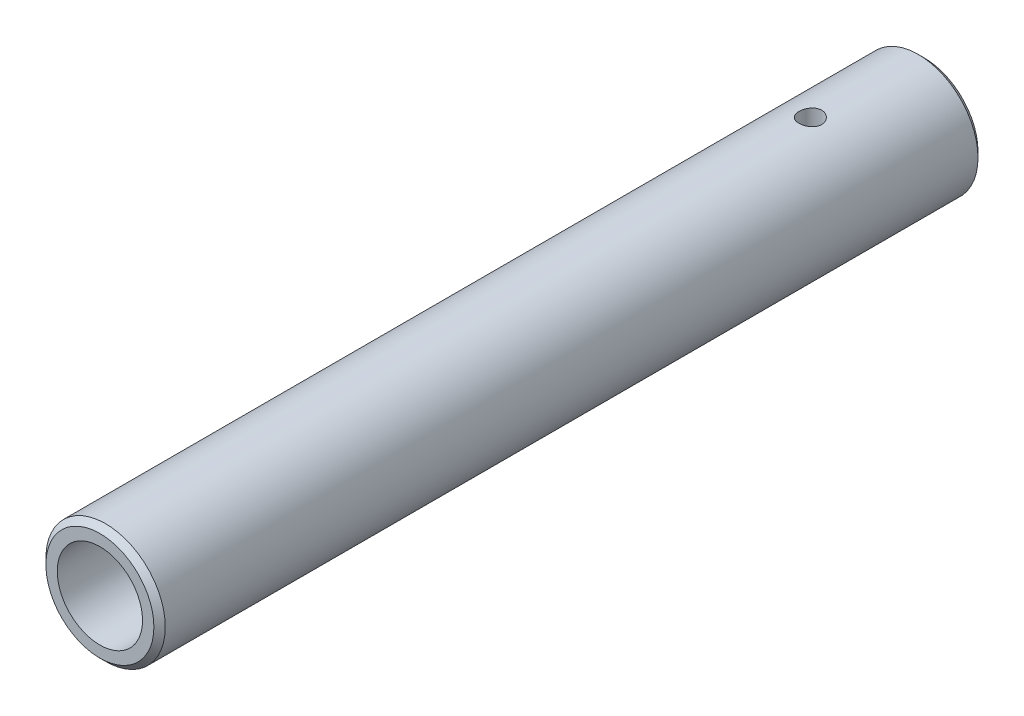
ISO-10303-21;
HEADER;
FILE_DESCRIPTION(('STEP AP214'),'2;1');
FILE_NAME('part.step','',(''),(''),'','','');
FILE_SCHEMA(('AUTOMOTIVE_DESIGN { 1 0 10303 214 1 1 1 1 }'));
ENDSEC;
DATA;
#1=APPLICATION_CONTEXT('core data for automotive mechanical design processes');
#2=APPLICATION_PROTOCOL_DEFINITION('international standard','automotive_design',2000,#1);
#3=PRODUCT_CONTEXT('',#1,'mechanical');
#4=PRODUCT('Part','Part','',(#3));
#5=PRODUCT_RELATED_PRODUCT_CATEGORY('part','',(#4));
#6=PRODUCT_DEFINITION_FORMATION('','',#4);
#7=PRODUCT_DEFINITION_CONTEXT('part definition',#1,'design');
#8=PRODUCT_DEFINITION('design','',#6,#7);
#9=PRODUCT_DEFINITION_SHAPE('','',#8);
#10=(LENGTH_UNIT() NAMED_UNIT(*) SI_UNIT(.MILLI.,.METRE.));
#11=(NAMED_UNIT(*) PLANE_ANGLE_UNIT() SI_UNIT($,.RADIAN.));
#12=(NAMED_UNIT(*) SI_UNIT($,.STERADIAN.) SOLID_ANGLE_UNIT());
#13=UNCERTAINTY_MEASURE_WITH_UNIT(LENGTH_MEASURE(1.E-05),#10,'distance_accuracy_value','');
#14=(GEOMETRIC_REPRESENTATION_CONTEXT(3) GLOBAL_UNCERTAINTY_ASSIGNED_CONTEXT((#13)) GLOBAL_UNIT_ASSIGNED_CONTEXT((#10,
#11,#12)) REPRESENTATION_CONTEXT('',''));
#15=CARTESIAN_POINT('',(0.,0.,0.));
#16=DIRECTION('',(0.,0.,1.));
#17=DIRECTION('',(1.,0.,0.));
#18=AXIS2_PLACEMENT_3D('',#15,#16,#17);
#19=CARTESIAN_POINT('',(0.,0.,145.));
#20=DIRECTION('',(0.,0.,1.));
#21=DIRECTION('',(1.,0.,0.));
#22=AXIS2_PLACEMENT_3D('',#19,#20,#21);
#23=PLANE('',#22);
#24=CARTESIAN_POINT('',(0.,0.,145.));
#25=DIRECTION('',(0.,0.,1.));
#26=DIRECTION('',(1.,0.,0.));
#27=AXIS2_PLACEMENT_3D('',#24,#25,#26);
#28=CIRCLE('',#27,9.5);
#29=CARTESIAN_POINT('',(9.5,0.,145.));
#30=VERTEX_POINT('',#29);
#31=EDGE_CURVE('E38',#30,#30,#28,.T.);
#32=ORIENTED_EDGE('',*,*,#31,.T.);
#33=EDGE_LOOP('',(#32));
#34=FACE_BOUND('',#33,.T.);
#35=CARTESIAN_POINT('',(0.,0.,145.));
#36=DIRECTION('',(0.,0.,1.));
#37=DIRECTION('',(1.,0.,0.));
#38=AXIS2_PLACEMENT_3D('',#35,#36,#37);
#39=CIRCLE('',#38,7.5);
#40=CARTESIAN_POINT('',(7.5,0.,145.));
#41=VERTEX_POINT('',#40);
#42=EDGE_CURVE('E43',#41,#41,#39,.T.);
#43=ORIENTED_EDGE('',*,*,#42,.F.);
#44=EDGE_LOOP('',(#43));
#45=FACE_BOUND('',#44,.T.);
#46=ADVANCED_FACE('F22',(#34,#45),#23,.T.);
#47=CARTESIAN_POINT('',(0.,0.,0.));
#48=DIRECTION('',(0.,0.,1.));
#49=DIRECTION('',(1.,0.,0.));
#50=AXIS2_PLACEMENT_3D('',#47,#48,#49);
#51=PLANE('',#50);
#52=CARTESIAN_POINT('',(0.,0.,0.));
#53=DIRECTION('',(0.,0.,1.));
#54=DIRECTION('',(1.,0.,0.));
#55=AXIS2_PLACEMENT_3D('',#52,#53,#54);
#56=CIRCLE('',#55,9.50000000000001);
#57=CARTESIAN_POINT('',(9.50000000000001,0.,0.));
#58=VERTEX_POINT('',#57);
#59=EDGE_CURVE('E10',#58,#58,#56,.F.);
#60=ORIENTED_EDGE('',*,*,#59,.T.);
#61=EDGE_LOOP('',(#60));
#62=FACE_BOUND('',#61,.T.);
#63=CARTESIAN_POINT('',(0.,0.,0.));
#64=DIRECTION('',(0.,0.,1.));
#65=DIRECTION('',(1.,0.,0.));
#66=AXIS2_PLACEMENT_3D('',#63,#64,#65);
#67=CIRCLE('',#66,7.5);
#68=CARTESIAN_POINT('',(7.5,0.,0.));
#69=VERTEX_POINT('',#68);
#70=EDGE_CURVE('E80',#69,#69,#67,.T.);
#71=ORIENTED_EDGE('',*,*,#70,.T.);
#72=EDGE_LOOP('',(#71));
#73=FACE_BOUND('',#72,.T.);
#74=ADVANCED_FACE('F88',(#62,#73),#51,.F.);
#75=CARTESIAN_POINT('',(0.,0.,145.));
#76=DIRECTION('',(0.,0.,-1.));
#77=DIRECTION('',(-1.,0.,0.));
#78=AXIS2_PLACEMENT_3D('',#75,#76,#77);
#79=CYLINDRICAL_SURFACE('',#78,10.5);
#80=CARTESIAN_POINT('',(0.,0.,144.));
#81=DIRECTION('',(0.,0.,1.));
#82=DIRECTION('',(1.,0.,0.));
#83=AXIS2_PLACEMENT_3D('',#80,#81,#82);
#84=CIRCLE('',#83,10.5);
#85=CARTESIAN_POINT('',(10.5,0.,144.));
#86=VERTEX_POINT('',#85);
#87=EDGE_CURVE('E30',#86,#86,#84,.F.);
#88=ORIENTED_EDGE('',*,*,#87,.T.);
#89=EDGE_LOOP('',(#88));
#90=FACE_BOUND('',#89,.T.);
#91=CARTESIAN_POINT('',(0.,0.,1.));
#92=DIRECTION('',(0.,0.,1.));
#93=DIRECTION('',(1.,0.,0.));
#94=AXIS2_PLACEMENT_3D('',#91,#92,#93);
#95=CIRCLE('',#94,10.5);
#96=CARTESIAN_POINT('',(10.5,0.,1.));
#97=VERTEX_POINT('',#96);
#98=EDGE_CURVE('E34',#97,#97,#95,.T.);
#99=ORIENTED_EDGE('',*,*,#98,.T.);
#100=EDGE_LOOP('',(#99));
#101=FACE_BOUND('',#100,.T.);
#102=CARTESIAN_POINT('',(0.,-10.5,22.));
#103=CARTESIAN_POINT('',(0.111262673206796,-10.4999979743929,21.9999957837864));
#104=CARTESIAN_POINT('',(0.222579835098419,-10.4982132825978,21.9906840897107));
#105=CARTESIAN_POINT('',(0.442075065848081,-10.4912658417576,21.9537086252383));
#106=CARTESIAN_POINT('',(0.550250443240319,-10.4861002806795,21.9260295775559));
#107=CARTESIAN_POINT('',(0.760256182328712,-10.4729686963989,21.8531994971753));
#108=CARTESIAN_POINT('',(0.862092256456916,-10.4650052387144,21.8080644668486));
#109=CARTESIAN_POINT('',(1.05673744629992,-10.4471465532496,21.7016495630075));
#110=CARTESIAN_POINT('',(1.14954724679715,-10.4372514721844,21.6403709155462));
#111=CARTESIAN_POINT('',(1.3246595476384,-10.4164844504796,21.5026057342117));
#112=CARTESIAN_POINT('',(1.40683456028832,-10.4056029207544,21.4259585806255));
#113=CARTESIAN_POINT('',(1.55724150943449,-10.3841602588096,21.259977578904));
#114=CARTESIAN_POINT('',(1.6254724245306,-10.3735991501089,21.1706428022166));
#115=CARTESIAN_POINT('',(1.74658749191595,-10.3538997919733,20.9809177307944));
#116=CARTESIAN_POINT('',(1.7993414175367,-10.3447739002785,20.88044290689));
#117=CARTESIAN_POINT('',(1.8871712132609,-10.3291136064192,20.6718536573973));
#118=CARTESIAN_POINT('',(1.92224865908,-10.3225789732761,20.563739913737));
#119=CARTESIAN_POINT('',(1.97331952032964,-10.3129377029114,20.3443076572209));
#120=CARTESIAN_POINT('',(1.98953558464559,-10.3097911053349,20.2330427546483));
#121=CARTESIAN_POINT('',(2.00311456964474,-10.307161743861,20.0093303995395));
#122=CARTESIAN_POINT('',(2.00047923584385,-10.307678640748,19.8968830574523));
#123=CARTESIAN_POINT('',(1.97661064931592,-10.3122815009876,19.6756145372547));
#124=CARTESIAN_POINT('',(1.95563105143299,-10.3163187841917,19.5667648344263));
#125=CARTESIAN_POINT('',(1.89606915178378,-10.3274310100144,19.3541589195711));
#126=CARTESIAN_POINT('',(1.85748608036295,-10.3345060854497,19.25040293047));
#127=CARTESIAN_POINT('',(1.76356576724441,-10.3509473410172,19.0501901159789));
#128=CARTESIAN_POINT('',(1.70812654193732,-10.3603273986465,18.9537823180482));
#129=CARTESIAN_POINT('',(1.58213972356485,-10.3803126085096,18.7715423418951));
#130=CARTESIAN_POINT('',(1.51159054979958,-10.3909178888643,18.685711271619));
#131=CARTESIAN_POINT('',(1.35602107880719,-10.4123704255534,18.5255960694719));
#132=CARTESIAN_POINT('',(1.27078393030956,-10.4232188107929,18.4515226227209));
#133=CARTESIAN_POINT('',(1.08898253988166,-10.4437767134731,18.3186937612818));
#134=CARTESIAN_POINT('',(0.992418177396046,-10.4534862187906,18.2599385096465));
#135=CARTESIAN_POINT('',(0.790480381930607,-10.4706929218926,18.1593810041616));
#136=CARTESIAN_POINT('',(0.685095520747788,-10.4781871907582,18.1176011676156));
#137=CARTESIAN_POINT('',(0.468628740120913,-10.4900964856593,18.0523961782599));
#138=CARTESIAN_POINT('',(0.357547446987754,-10.4945118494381,18.0289690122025));
#139=CARTESIAN_POINT('',(0.134653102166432,-10.4997193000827,18.0014287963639));
#140=CARTESIAN_POINT('',(0.0228769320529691,-10.5005655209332,17.9970271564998));
#141=CARTESIAN_POINT('',(-0.199814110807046,-10.498689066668,18.0068881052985));
#142=CARTESIAN_POINT('',(-0.31072902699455,-10.4959665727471,18.0211497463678));
#143=CARTESIAN_POINT('',(-0.527630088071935,-10.487292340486,18.0676925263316));
#144=CARTESIAN_POINT('',(-0.633648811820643,-10.481366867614,18.0998271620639));
#145=CARTESIAN_POINT('',(-0.838793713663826,-10.4669484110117,18.1810448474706));
#146=CARTESIAN_POINT('',(-0.937919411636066,-10.4584552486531,18.2301290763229));
#147=CARTESIAN_POINT('',(-1.12769270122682,-10.4397084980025,18.3444880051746));
#148=CARTESIAN_POINT('',(-1.21823250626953,-10.4294362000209,18.4099384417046));
#149=CARTESIAN_POINT('',(-1.3871474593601,-10.4083178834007,18.5549346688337));
#150=CARTESIAN_POINT('',(-1.46552143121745,-10.3974718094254,18.6344818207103));
#151=CARTESIAN_POINT('',(-1.60898057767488,-10.376248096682,18.8067216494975));
#152=CARTESIAN_POINT('',(-1.67386852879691,-10.3658789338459,18.899579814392));
#153=CARTESIAN_POINT('',(-1.78712564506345,-10.3469557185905,19.0950475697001));
#154=CARTESIAN_POINT('',(-1.83549543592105,-10.3384015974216,19.1976567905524));
#155=CARTESIAN_POINT('',(-1.9140659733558,-10.3241439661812,19.4092209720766));
#156=CARTESIAN_POINT('',(-1.94435593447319,-10.3184264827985,19.5181418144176));
#157=CARTESIAN_POINT('',(-1.98618111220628,-10.3104580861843,19.7396462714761));
#158=CARTESIAN_POINT('',(-1.99771852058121,-10.3082067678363,19.8522294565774));
#159=CARTESIAN_POINT('',(-2.00163592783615,-10.3074466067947,20.0758861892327));
#160=CARTESIAN_POINT('',(-1.99432714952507,-10.3088769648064,20.1869541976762));
#161=CARTESIAN_POINT('',(-1.96144230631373,-10.3151839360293,20.4062472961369));
#162=CARTESIAN_POINT('',(-1.93586635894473,-10.3200605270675,20.5144724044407));
#163=CARTESIAN_POINT('',(-1.86730626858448,-10.3326845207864,20.724833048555));
#164=CARTESIAN_POINT('',(-1.82435686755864,-10.3404261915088,20.8269802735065));
#165=CARTESIAN_POINT('',(-1.72230346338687,-10.357911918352,21.022668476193));
#166=CARTESIAN_POINT('',(-1.66319826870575,-10.367656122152,21.116208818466));
#167=CARTESIAN_POINT('',(-1.52943348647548,-10.3882370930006,21.2935848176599));
#168=CARTESIAN_POINT('',(-1.45454780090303,-10.3990884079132,21.37724830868));
#169=CARTESIAN_POINT('',(-1.29181816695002,-10.4205531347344,21.5309253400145));
#170=CARTESIAN_POINT('',(-1.20397124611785,-10.4311664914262,21.6009357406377));
#171=CARTESIAN_POINT('',(-1.01682937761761,-10.4510758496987,21.7259315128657));
#172=CARTESIAN_POINT('',(-0.917435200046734,-10.4603586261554,21.7807704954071));
#173=CARTESIAN_POINT('',(-0.710697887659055,-10.4764315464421,21.8728828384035));
#174=CARTESIAN_POINT('',(-0.603362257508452,-10.4832240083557,21.9101725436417));
#175=CARTESIAN_POINT('',(-0.41310668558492,-10.49218127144,21.9586373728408));
#176=CARTESIAN_POINT('',(-0.331292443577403,-10.4950965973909,21.974121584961));
#177=CARTESIAN_POINT('',(-0.166328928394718,-10.4990066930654,21.9948043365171));
#178=CARTESIAN_POINT('',(-0.0831796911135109,-10.5000015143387,22.0000031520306));
#179=CARTESIAN_POINT('',(0.,-10.5,22.));
#180=B_SPLINE_CURVE_WITH_KNOTS('',3,(#102,#103,#104,#105,#106,#107,#108,#109,#110,#111,#112,
#113,#114,#115,#116,#117,#118,#119,#120,#121,#122,#123,#124,#125,#126,#127,#128,#129,#130,#131,
#132,#133,#134,#135,#136,#137,#138,#139,#140,#141,#142,#143,#144,#145,#146,#147,#148,#149,#150,
#151,#152,#153,#154,#155,#156,#157,#158,#159,#160,#161,#162,#163,#164,#165,#166,#167,#168,#169,
#170,#171,#172,#173,#174,#175,#176,#177,#178,#179),.UNSPECIFIED.,.T.,.F.,(4,2,2,2,2,2,2,2,2,2,2,
2,2,2,2,2,2,2,2,2,2,2,2,2,2,2,2,2,2,2,2,2,2,2,2,2,2,2,4),(0.,0.333483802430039,
0.667245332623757,1.00070161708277,1.33413258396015,1.67124928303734,2.0083906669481,
2.34829242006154,2.68816386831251,3.02398123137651,3.35976750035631,3.69098283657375,
4.02221265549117,4.35548777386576,4.68879777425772,5.0275329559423,5.36627174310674,
5.70545641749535,6.04460387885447,6.37858849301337,6.71255615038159,7.04382581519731,
7.37511853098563,7.71013402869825,8.04518189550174,8.38482983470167,8.72446490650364,
9.06240989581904,9.4003153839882,9.7326766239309,10.0650357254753,10.3967334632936,
10.7284556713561,11.065300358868,11.4022224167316,11.7422902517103,12.0820407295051,
12.3313590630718,12.5806707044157),.UNSPECIFIED.);
#181=CARTESIAN_POINT('',(0.,-10.5,22.));
#182=VERTEX_POINT('',#181);
#183=EDGE_CURVE('E75',#182,#182,#180,.T.);
#184=ORIENTED_EDGE('',*,*,#183,.T.);
#185=EDGE_LOOP('',(#184));
#186=FACE_BOUND('',#185,.T.);
#187=CARTESIAN_POINT('',(0.,10.5,22.));
#188=CARTESIAN_POINT('',(-0.111262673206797,10.4999979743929,21.9999957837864));
#189=CARTESIAN_POINT('',(-0.222579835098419,10.4982132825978,21.9906840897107));
#190=CARTESIAN_POINT('',(-0.442075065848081,10.4912658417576,21.9537086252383));
#191=CARTESIAN_POINT('',(-0.550250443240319,10.4861002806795,21.9260295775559));
#192=CARTESIAN_POINT('',(-0.760256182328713,10.4729686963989,21.8531994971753));
#193=CARTESIAN_POINT('',(-0.862092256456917,10.4650052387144,21.8080644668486));
#194=CARTESIAN_POINT('',(-1.05673744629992,10.4471465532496,21.7016495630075));
#195=CARTESIAN_POINT('',(-1.14954724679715,10.4372514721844,21.6403709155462));
#196=CARTESIAN_POINT('',(-1.3246595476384,10.4164844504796,21.5026057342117));
#197=CARTESIAN_POINT('',(-1.40683456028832,10.4056029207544,21.4259585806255));
#198=CARTESIAN_POINT('',(-1.55724150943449,10.3841602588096,21.259977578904));
#199=CARTESIAN_POINT('',(-1.6254724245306,10.3735991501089,21.1706428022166));
#200=CARTESIAN_POINT('',(-1.74658749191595,10.3538997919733,20.9809177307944));
#201=CARTESIAN_POINT('',(-1.7993414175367,10.3447739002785,20.88044290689));
#202=CARTESIAN_POINT('',(-1.88717121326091,10.3291136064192,20.6718536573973));
#203=CARTESIAN_POINT('',(-1.92224865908,10.3225789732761,20.563739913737));
#204=CARTESIAN_POINT('',(-1.97331952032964,10.3129377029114,20.3443076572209));
#205=CARTESIAN_POINT('',(-1.98953558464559,10.3097911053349,20.2330427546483));
#206=CARTESIAN_POINT('',(-2.00311456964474,10.307161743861,20.0093303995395));
#207=CARTESIAN_POINT('',(-2.00047923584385,10.307678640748,19.8968830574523));
#208=CARTESIAN_POINT('',(-1.97661064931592,10.3122815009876,19.6756145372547));
#209=CARTESIAN_POINT('',(-1.95563105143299,10.3163187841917,19.5667648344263));
#210=CARTESIAN_POINT('',(-1.89606915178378,10.3274310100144,19.3541589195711));
#211=CARTESIAN_POINT('',(-1.85748608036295,10.3345060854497,19.25040293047));
#212=CARTESIAN_POINT('',(-1.76356576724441,10.3509473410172,19.0501901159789));
#213=CARTESIAN_POINT('',(-1.70812654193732,10.3603273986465,18.9537823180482));
#214=CARTESIAN_POINT('',(-1.58213972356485,10.3803126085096,18.7715423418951));
#215=CARTESIAN_POINT('',(-1.51159054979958,10.3909178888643,18.685711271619));
#216=CARTESIAN_POINT('',(-1.35602107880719,10.4123704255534,18.5255960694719));
#217=CARTESIAN_POINT('',(-1.27078393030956,10.4232188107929,18.4515226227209));
#218=CARTESIAN_POINT('',(-1.08898253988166,10.4437767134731,18.3186937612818));
#219=CARTESIAN_POINT('',(-0.992418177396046,10.4534862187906,18.2599385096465));
#220=CARTESIAN_POINT('',(-0.790480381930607,10.4706929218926,18.1593810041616));
#221=CARTESIAN_POINT('',(-0.685095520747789,10.4781871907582,18.1176011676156));
#222=CARTESIAN_POINT('',(-0.468628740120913,10.4900964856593,18.0523961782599));
#223=CARTESIAN_POINT('',(-0.357547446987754,10.4945118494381,18.0289690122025));
#224=CARTESIAN_POINT('',(-0.134653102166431,10.4997193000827,18.0014287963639));
#225=CARTESIAN_POINT('',(-0.0228769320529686,10.5005655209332,17.9970271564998));
#226=CARTESIAN_POINT('',(0.199814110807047,10.498689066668,18.0068881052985));
#227=CARTESIAN_POINT('',(0.310729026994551,10.4959665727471,18.0211497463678));
#228=CARTESIAN_POINT('',(0.527630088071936,10.487292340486,18.0676925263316));
#229=CARTESIAN_POINT('',(0.633648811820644,10.481366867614,18.0998271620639));
#230=CARTESIAN_POINT('',(0.838793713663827,10.4669484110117,18.1810448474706));
#231=CARTESIAN_POINT('',(0.937919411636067,10.4584552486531,18.2301290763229));
#232=CARTESIAN_POINT('',(1.12769270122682,10.4397084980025,18.3444880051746));
#233=CARTESIAN_POINT('',(1.21823250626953,10.4294362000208,18.4099384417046));
#234=CARTESIAN_POINT('',(1.3871474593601,10.4083178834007,18.5549346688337));
#235=CARTESIAN_POINT('',(1.46552143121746,10.3974718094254,18.6344818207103));
#236=CARTESIAN_POINT('',(1.60898057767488,10.376248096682,18.8067216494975));
#237=CARTESIAN_POINT('',(1.67386852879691,10.3658789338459,18.899579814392));
#238=CARTESIAN_POINT('',(1.78712564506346,10.3469557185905,19.0950475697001));
#239=CARTESIAN_POINT('',(1.83549543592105,10.3384015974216,19.1976567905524));
#240=CARTESIAN_POINT('',(1.9140659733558,10.3241439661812,19.4092209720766));
#241=CARTESIAN_POINT('',(1.94435593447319,10.3184264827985,19.5181418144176));
#242=CARTESIAN_POINT('',(1.98618111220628,10.3104580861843,19.7396462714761));
#243=CARTESIAN_POINT('',(1.99771852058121,10.3082067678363,19.8522294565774));
#244=CARTESIAN_POINT('',(2.00163592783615,10.3074466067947,20.0758861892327));
#245=CARTESIAN_POINT('',(1.99432714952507,10.3088769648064,20.1869541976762));
#246=CARTESIAN_POINT('',(1.96144230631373,10.3151839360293,20.4062472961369));
#247=CARTESIAN_POINT('',(1.93586635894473,10.3200605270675,20.5144724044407));
#248=CARTESIAN_POINT('',(1.86730626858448,10.3326845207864,20.724833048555));
#249=CARTESIAN_POINT('',(1.82435686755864,10.3404261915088,20.8269802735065));
#250=CARTESIAN_POINT('',(1.72230346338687,10.357911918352,21.022668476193));
#251=CARTESIAN_POINT('',(1.66319826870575,10.367656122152,21.116208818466));
#252=CARTESIAN_POINT('',(1.52943348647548,10.3882370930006,21.2935848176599));
#253=CARTESIAN_POINT('',(1.45454780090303,10.3990884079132,21.37724830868));
#254=CARTESIAN_POINT('',(1.29181816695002,10.4205531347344,21.5309253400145));
#255=CARTESIAN_POINT('',(1.20397124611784,10.4311664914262,21.6009357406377));
#256=CARTESIAN_POINT('',(1.01682937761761,10.4510758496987,21.7259315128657));
#257=CARTESIAN_POINT('',(0.917435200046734,10.4603586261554,21.7807704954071));
#258=CARTESIAN_POINT('',(0.710697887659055,10.4764315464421,21.8728828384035));
#259=CARTESIAN_POINT('',(0.603362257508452,10.4832240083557,21.9101725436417));
#260=CARTESIAN_POINT('',(0.41310668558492,10.49218127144,21.9586373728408));
#261=CARTESIAN_POINT('',(0.331292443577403,10.4950965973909,21.974121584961));
#262=CARTESIAN_POINT('',(0.166328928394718,10.4990066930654,21.9948043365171));
#263=CARTESIAN_POINT('',(0.0831796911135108,10.5000015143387,22.0000031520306));
#264=CARTESIAN_POINT('',(0.,10.5,22.));
#265=B_SPLINE_CURVE_WITH_KNOTS('',3,(#187,#188,#189,#190,#191,#192,#193,#194,#195,#196,#197,
#198,#199,#200,#201,#202,#203,#204,#205,#206,#207,#208,#209,#210,#211,#212,#213,#214,#215,#216,
#217,#218,#219,#220,#221,#222,#223,#224,#225,#226,#227,#228,#229,#230,#231,#232,#233,#234,#235,
#236,#237,#238,#239,#240,#241,#242,#243,#244,#245,#246,#247,#248,#249,#250,#251,#252,#253,#254,
#255,#256,#257,#258,#259,#260,#261,#262,#263,#264),.UNSPECIFIED.,.T.,.F.,(4,2,2,2,2,2,2,2,2,2,2,
2,2,2,2,2,2,2,2,2,2,2,2,2,2,2,2,2,2,2,2,2,2,2,2,2,2,2,4),(0.,0.33348380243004,0.667245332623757,
1.00070161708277,1.33413258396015,1.67124928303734,2.00839066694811,2.34829242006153,
2.6881638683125,3.0239812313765,3.35976750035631,3.69098283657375,4.02221265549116,
4.35548777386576,4.68879777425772,5.02753295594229,5.36627174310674,5.70545641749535,
6.04460387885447,6.37858849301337,6.71255615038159,7.04382581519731,7.37511853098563,
7.71013402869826,8.04518189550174,8.38482983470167,8.72446490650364,9.06240989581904,
9.40031538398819,9.7326766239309,10.0650357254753,10.3967334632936,10.7284556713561,
11.065300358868,11.4022224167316,11.7422902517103,12.0820407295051,12.3313590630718,
12.5806707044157),.UNSPECIFIED.);
#266=CARTESIAN_POINT('',(0.,10.5,22.));
#267=VERTEX_POINT('',#266);
#268=EDGE_CURVE('E51',#267,#267,#265,.T.);
#269=ORIENTED_EDGE('',*,*,#268,.T.);
#270=EDGE_LOOP('',(#269));
#271=FACE_BOUND('',#270,.T.);
#272=ADVANCED_FACE('F24',(#90,#101,#186,#271),#79,.T.);
#273=CARTESIAN_POINT('',(0.,0.,145.));
#274=DIRECTION('',(0.,0.,-1.));
#275=DIRECTION('',(-1.,0.,0.));
#276=AXIS2_PLACEMENT_3D('',#273,#274,#275);
#277=CYLINDRICAL_SURFACE('',#276,7.5);
#278=CARTESIAN_POINT('',(0.,-7.5,22.));
#279=CARTESIAN_POINT('',(0.110254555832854,-7.49999833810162,21.9999973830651));
#280=CARTESIAN_POINT('',(0.22053716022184,-7.49754486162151,21.9908523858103));
#281=CARTESIAN_POINT('',(0.437925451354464,-7.48799573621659,21.9545787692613));
#282=CARTESIAN_POINT('',(0.545029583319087,-7.48089785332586,21.9274414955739));
#283=CARTESIAN_POINT('',(0.752891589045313,-7.4628433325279,21.856128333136));
#284=CARTESIAN_POINT('',(0.853657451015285,-7.45189167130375,21.811974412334));
#285=CARTESIAN_POINT('',(1.04635368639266,-7.42728699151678,21.7079627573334));
#286=CARTESIAN_POINT('',(1.13828347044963,-7.4136337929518,21.6481039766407));
#287=CARTESIAN_POINT('',(1.31282950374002,-7.38474614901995,21.5129164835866));
#288=CARTESIAN_POINT('',(1.39521168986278,-7.36948467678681,21.4372913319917));
#289=CARTESIAN_POINT('',(1.54628713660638,-7.33927409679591,21.2733515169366));
#290=CARTESIAN_POINT('',(1.61497863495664,-7.32432502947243,21.1850352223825));
#291=CARTESIAN_POINT('',(1.73786409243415,-7.29615537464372,20.9963517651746));
#292=CARTESIAN_POINT('',(1.79178877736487,-7.28296888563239,20.8958036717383));
#293=CARTESIAN_POINT('',(1.88187548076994,-7.26021477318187,20.6866598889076));
#294=CARTESIAN_POINT('',(1.91804077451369,-7.25064648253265,20.5780656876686));
#295=CARTESIAN_POINT('',(1.97076920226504,-7.23649115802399,20.358504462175));
#296=CARTESIAN_POINT('',(1.98775670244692,-7.2317964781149,20.2476464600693));
#297=CARTESIAN_POINT('',(2.0029703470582,-7.2275983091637,20.0245623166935));
#298=CARTESIAN_POINT('',(2.00119999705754,-7.22809385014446,19.9123364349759));
#299=CARTESIAN_POINT('',(1.97928510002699,-7.2341237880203,19.6930145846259));
#300=CARTESIAN_POINT('',(1.95965406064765,-7.23951735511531,19.5858628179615));
#301=CARTESIAN_POINT('',(1.90339748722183,-7.25451013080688,19.3764316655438));
#302=CARTESIAN_POINT('',(1.86677059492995,-7.26410967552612,19.2741526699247));
#303=CARTESIAN_POINT('',(1.77714356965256,-7.28655661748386,19.0760318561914));
#304=CARTESIAN_POINT('',(1.72396341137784,-7.29943942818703,18.9802756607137));
#305=CARTESIAN_POINT('',(1.60286503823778,-7.32698229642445,18.7988658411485));
#306=CARTESIAN_POINT('',(1.53494392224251,-7.34164270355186,18.7132142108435));
#307=CARTESIAN_POINT('',(1.38366607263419,-7.37167510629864,18.5515110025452));
#308=CARTESIAN_POINT('',(1.29987812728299,-7.38705471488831,18.475863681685));
#309=CARTESIAN_POINT('',(1.12061766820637,-7.41636381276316,18.3396112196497));
#310=CARTESIAN_POINT('',(1.02514469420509,-7.43029324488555,18.2790066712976));
#311=CARTESIAN_POINT('',(0.824598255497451,-7.45521820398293,18.1743820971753));
#312=CARTESIAN_POINT('',(0.719484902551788,-7.4662007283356,18.1304352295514));
#313=CARTESIAN_POINT('',(0.503002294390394,-7.48390044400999,18.0609528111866));
#314=CARTESIAN_POINT('',(0.391634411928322,-7.49061856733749,18.035413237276));
#315=CARTESIAN_POINT('',(0.169254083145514,-7.49889158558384,18.0041051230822));
#316=CARTESIAN_POINT('',(0.0583242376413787,-7.50058997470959,17.9977869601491));
#317=CARTESIAN_POINT('',(-0.1630100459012,-7.49904471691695,18.0035831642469));
#318=CARTESIAN_POINT('',(-0.273414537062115,-7.49580158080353,18.0156956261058));
#319=CARTESIAN_POINT('',(-0.488602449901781,-7.48483035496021,18.05755844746));
#320=CARTESIAN_POINT('',(-0.593449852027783,-7.47718026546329,18.0870022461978));
#321=CARTESIAN_POINT('',(-0.796706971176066,-7.45826294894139,18.1623359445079));
#322=CARTESIAN_POINT('',(-0.895115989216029,-7.44699532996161,18.2082276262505));
#323=CARTESIAN_POINT('',(-1.08483847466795,-7.42175660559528,18.3161738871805));
#324=CARTESIAN_POINT('',(-1.17597518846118,-7.40773686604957,18.3785274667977));
#325=CARTESIAN_POINT('',(-1.34668463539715,-7.37861452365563,18.517251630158));
#326=CARTESIAN_POINT('',(-1.42625507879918,-7.3635117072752,18.5936249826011));
#327=CARTESIAN_POINT('',(-1.57388924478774,-7.33339745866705,18.7607855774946));
#328=CARTESIAN_POINT('',(-1.64156519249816,-7.31840061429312,18.8519185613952));
#329=CARTESIAN_POINT('',(-1.76067191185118,-7.29066447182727,19.0445646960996));
#330=CARTESIAN_POINT('',(-1.81210336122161,-7.27792507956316,19.1460774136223));
#331=CARTESIAN_POINT('',(-1.89687411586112,-7.2562926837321,19.3560953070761));
#332=CARTESIAN_POINT('',(-1.93031812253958,-7.24737748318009,19.4645558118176));
#333=CARTESIAN_POINT('',(-1.97841205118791,-7.23439825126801,19.6858393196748));
#334=CARTESIAN_POINT('',(-1.99306677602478,-7.23033298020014,19.7986612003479));
#335=CARTESIAN_POINT('',(-2.00288989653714,-7.22761744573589,20.0214947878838));
#336=CARTESIAN_POINT('',(-1.99868155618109,-7.22879397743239,20.1314773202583));
#337=CARTESIAN_POINT('',(-1.97234376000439,-7.23602396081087,20.34910351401));
#338=CARTESIAN_POINT('',(-1.95021476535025,-7.24207728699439,20.4567472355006));
#339=CARTESIAN_POINT('',(-1.88902515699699,-7.25827571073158,20.6658557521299));
#340=CARTESIAN_POINT('',(-1.8500966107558,-7.26838885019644,20.7673618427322));
#341=CARTESIAN_POINT('',(-1.75651554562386,-7.29156818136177,20.9624788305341));
#342=CARTESIAN_POINT('',(-1.70186056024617,-7.30463483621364,21.0560884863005));
#343=CARTESIAN_POINT('',(-1.57648909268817,-7.3327292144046,21.2357303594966));
#344=CARTESIAN_POINT('',(-1.50534729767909,-7.3478033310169,21.3214585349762));
#345=CARTESIAN_POINT('',(-1.349830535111,-7.37795503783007,21.4799624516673));
#346=CARTESIAN_POINT('',(-1.26545235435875,-7.39303262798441,21.5527350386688));
#347=CARTESIAN_POINT('',(-1.08367998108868,-7.42187812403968,21.6847922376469));
#348=CARTESIAN_POINT('',(-0.986045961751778,-7.43561111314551,21.7437550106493));
#349=CARTESIAN_POINT('',(-0.781888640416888,-7.45983810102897,21.8443374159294));
#350=CARTESIAN_POINT('',(-0.675371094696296,-7.47033417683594,21.8859681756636));
#351=CARTESIAN_POINT('',(-0.47437470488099,-7.48554752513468,21.9452752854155));
#352=CARTESIAN_POINT('',(-0.380762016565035,-7.49092770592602,21.9657493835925));
#353=CARTESIAN_POINT('',(-0.191439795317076,-7.49815449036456,21.9931122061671));
#354=CARTESIAN_POINT('',(-0.0957304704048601,-7.5000014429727,22.0000022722));
#355=CARTESIAN_POINT('',(0.,-7.5,22.));
#356=B_SPLINE_CURVE_WITH_KNOTS('',3,(#278,#279,#280,#281,#282,#283,#284,#285,#286,#287,#288,
#289,#290,#291,#292,#293,#294,#295,#296,#297,#298,#299,#300,#301,#302,#303,#304,#305,#306,#307,
#308,#309,#310,#311,#312,#313,#314,#315,#316,#317,#318,#319,#320,#321,#322,#323,#324,#325,#326,
#327,#328,#329,#330,#331,#332,#333,#334,#335,#336,#337,#338,#339,#340,#341,#342,#343,#344,#345,
#346,#347,#348,#349,#350,#351,#352,#353,#354,#355),.UNSPECIFIED.,.T.,.F.,(4,2,2,2,2,2,2,2,2,2,2,
2,2,2,2,2,2,2,2,2,2,2,2,2,2,2,2,2,2,2,2,2,2,2,2,2,2,2,4),(0.,0.330412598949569,
0.660984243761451,0.991130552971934,1.32129886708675,1.65834897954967,1.99544244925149,
2.33832582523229,2.681145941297,3.01622158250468,3.3512346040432,3.67691002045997,
4.0026114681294,4.33198673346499,4.6614268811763,5.00161259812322,5.34181171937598,
5.68348809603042,6.02508977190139,6.35682717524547,6.68853028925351,7.01453535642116,
7.34057575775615,7.6730028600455,8.00549568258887,8.34736496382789,8.68921998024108,
9.02906297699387,9.36881908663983,9.69743342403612,10.0260393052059,10.352107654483,
10.67822717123,11.0139433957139,11.3497412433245,11.692722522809,12.0354832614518,
12.3223981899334,12.6092847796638),.UNSPECIFIED.);
#357=CARTESIAN_POINT('',(0.,-7.5,22.));
#358=VERTEX_POINT('',#357);
#359=EDGE_CURVE('E44',#358,#358,#356,.T.);
#360=ORIENTED_EDGE('',*,*,#359,.F.);
#361=EDGE_LOOP('',(#360));
#362=FACE_BOUND('',#361,.T.);
#363=CARTESIAN_POINT('',(0.,7.5,22.));
#364=CARTESIAN_POINT('',(-0.110254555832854,7.49999833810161,21.9999973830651));
#365=CARTESIAN_POINT('',(-0.220537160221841,7.49754486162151,21.9908523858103));
#366=CARTESIAN_POINT('',(-0.437925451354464,7.48799573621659,21.9545787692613));
#367=CARTESIAN_POINT('',(-0.545029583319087,7.48089785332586,21.9274414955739));
#368=CARTESIAN_POINT('',(-0.752891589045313,7.4628433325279,21.856128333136));
#369=CARTESIAN_POINT('',(-0.853657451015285,7.45189167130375,21.811974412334));
#370=CARTESIAN_POINT('',(-1.04635368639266,7.42728699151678,21.7079627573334));
#371=CARTESIAN_POINT('',(-1.13828347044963,7.4136337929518,21.6481039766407));
#372=CARTESIAN_POINT('',(-1.31282950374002,7.38474614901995,21.5129164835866));
#373=CARTESIAN_POINT('',(-1.39521168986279,7.36948467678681,21.4372913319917));
#374=CARTESIAN_POINT('',(-1.54628713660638,7.33927409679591,21.2733515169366));
#375=CARTESIAN_POINT('',(-1.61497863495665,7.32432502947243,21.1850352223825));
#376=CARTESIAN_POINT('',(-1.73786409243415,7.29615537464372,20.9963517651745));
#377=CARTESIAN_POINT('',(-1.79178877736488,7.28296888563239,20.8958036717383));
#378=CARTESIAN_POINT('',(-1.88187548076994,7.26021477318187,20.6866598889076));
#379=CARTESIAN_POINT('',(-1.91804077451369,7.25064648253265,20.5780656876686));
#380=CARTESIAN_POINT('',(-1.97076920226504,7.23649115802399,20.358504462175));
#381=CARTESIAN_POINT('',(-1.98775670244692,7.2317964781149,20.2476464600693));
#382=CARTESIAN_POINT('',(-2.0029703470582,7.2275983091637,20.0245623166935));
#383=CARTESIAN_POINT('',(-2.00119999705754,7.22809385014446,19.9123364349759));
#384=CARTESIAN_POINT('',(-1.97928510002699,7.2341237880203,19.6930145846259));
#385=CARTESIAN_POINT('',(-1.95965406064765,7.23951735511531,19.5858628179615));
#386=CARTESIAN_POINT('',(-1.90339748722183,7.25451013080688,19.3764316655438));
#387=CARTESIAN_POINT('',(-1.86677059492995,7.26410967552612,19.2741526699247));
#388=CARTESIAN_POINT('',(-1.77714356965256,7.28655661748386,19.0760318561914));
#389=CARTESIAN_POINT('',(-1.72396341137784,7.29943942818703,18.9802756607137));
#390=CARTESIAN_POINT('',(-1.60286503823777,7.32698229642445,18.7988658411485));
#391=CARTESIAN_POINT('',(-1.53494392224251,7.34164270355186,18.7132142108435));
#392=CARTESIAN_POINT('',(-1.38366607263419,7.37167510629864,18.5515110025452));
#393=CARTESIAN_POINT('',(-1.29987812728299,7.38705471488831,18.475863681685));
#394=CARTESIAN_POINT('',(-1.12061766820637,7.41636381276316,18.3396112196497));
#395=CARTESIAN_POINT('',(-1.02514469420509,7.43029324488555,18.2790066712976));
#396=CARTESIAN_POINT('',(-0.824598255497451,7.45521820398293,18.1743820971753));
#397=CARTESIAN_POINT('',(-0.719484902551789,7.4662007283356,18.1304352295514));
#398=CARTESIAN_POINT('',(-0.503002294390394,7.48390044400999,18.0609528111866));
#399=CARTESIAN_POINT('',(-0.391634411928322,7.49061856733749,18.035413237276));
#400=CARTESIAN_POINT('',(-0.169254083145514,7.49889158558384,18.0041051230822));
#401=CARTESIAN_POINT('',(-0.058324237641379,7.50058997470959,17.9977869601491));
#402=CARTESIAN_POINT('',(0.1630100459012,7.49904471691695,18.0035831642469));
#403=CARTESIAN_POINT('',(0.273414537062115,7.49580158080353,18.0156956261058));
#404=CARTESIAN_POINT('',(0.488602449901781,7.48483035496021,18.05755844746));
#405=CARTESIAN_POINT('',(0.593449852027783,7.47718026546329,18.0870022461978));
#406=CARTESIAN_POINT('',(0.796706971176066,7.45826294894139,18.1623359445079));
#407=CARTESIAN_POINT('',(0.895115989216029,7.44699532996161,18.2082276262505));
#408=CARTESIAN_POINT('',(1.08483847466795,7.42175660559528,18.3161738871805));
#409=CARTESIAN_POINT('',(1.17597518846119,7.40773686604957,18.3785274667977));
#410=CARTESIAN_POINT('',(1.34668463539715,7.37861452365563,18.517251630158));
#411=CARTESIAN_POINT('',(1.42625507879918,7.3635117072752,18.5936249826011));
#412=CARTESIAN_POINT('',(1.57388924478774,7.33339745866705,18.7607855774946));
#413=CARTESIAN_POINT('',(1.64156519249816,7.31840061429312,18.8519185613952));
#414=CARTESIAN_POINT('',(1.76067191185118,7.29066447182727,19.0445646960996));
#415=CARTESIAN_POINT('',(1.81210336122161,7.27792507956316,19.1460774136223));
#416=CARTESIAN_POINT('',(1.89687411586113,7.2562926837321,19.3560953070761));
#417=CARTESIAN_POINT('',(1.93031812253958,7.24737748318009,19.4645558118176));
#418=CARTESIAN_POINT('',(1.97841205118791,7.23439825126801,19.6858393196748));
#419=CARTESIAN_POINT('',(1.99306677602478,7.23033298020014,19.7986612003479));
#420=CARTESIAN_POINT('',(2.00288989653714,7.22761744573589,20.0214947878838));
#421=CARTESIAN_POINT('',(1.99868155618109,7.22879397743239,20.1314773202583));
#422=CARTESIAN_POINT('',(1.97234376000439,7.23602396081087,20.34910351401));
#423=CARTESIAN_POINT('',(1.95021476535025,7.24207728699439,20.4567472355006));
#424=CARTESIAN_POINT('',(1.88902515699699,7.25827571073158,20.6658557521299));
#425=CARTESIAN_POINT('',(1.8500966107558,7.26838885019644,20.7673618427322));
#426=CARTESIAN_POINT('',(1.75651554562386,7.29156818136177,20.9624788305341));
#427=CARTESIAN_POINT('',(1.70186056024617,7.30463483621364,21.0560884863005));
#428=CARTESIAN_POINT('',(1.57648909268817,7.3327292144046,21.2357303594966));
#429=CARTESIAN_POINT('',(1.50534729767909,7.3478033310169,21.3214585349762));
#430=CARTESIAN_POINT('',(1.349830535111,7.37795503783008,21.4799624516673));
#431=CARTESIAN_POINT('',(1.26545235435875,7.39303262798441,21.5527350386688));
#432=CARTESIAN_POINT('',(1.08367998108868,7.42187812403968,21.6847922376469));
#433=CARTESIAN_POINT('',(0.986045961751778,7.43561111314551,21.7437550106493));
#434=CARTESIAN_POINT('',(0.781888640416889,7.45983810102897,21.8443374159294));
#435=CARTESIAN_POINT('',(0.675371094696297,7.47033417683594,21.8859681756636));
#436=CARTESIAN_POINT('',(0.474374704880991,7.48554752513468,21.9452752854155));
#437=CARTESIAN_POINT('',(0.380762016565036,7.49092770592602,21.9657493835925));
#438=CARTESIAN_POINT('',(0.191439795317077,7.49815449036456,21.9931122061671));
#439=CARTESIAN_POINT('',(0.0957304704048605,7.5000014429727,22.0000022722));
#440=CARTESIAN_POINT('',(0.,7.5,22.));
#441=B_SPLINE_CURVE_WITH_KNOTS('',3,(#363,#364,#365,#366,#367,#368,#369,#370,#371,#372,#373,
#374,#375,#376,#377,#378,#379,#380,#381,#382,#383,#384,#385,#386,#387,#388,#389,#390,#391,#392,
#393,#394,#395,#396,#397,#398,#399,#400,#401,#402,#403,#404,#405,#406,#407,#408,#409,#410,#411,
#412,#413,#414,#415,#416,#417,#418,#419,#420,#421,#422,#423,#424,#425,#426,#427,#428,#429,#430,
#431,#432,#433,#434,#435,#436,#437,#438,#439,#440),.UNSPECIFIED.,.T.,.F.,(4,2,2,2,2,2,2,2,2,2,2,
2,2,2,2,2,2,2,2,2,2,2,2,2,2,2,2,2,2,2,2,2,2,2,2,2,2,2,4),(0.,0.330412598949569,
0.660984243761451,0.991130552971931,1.32129886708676,1.65834897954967,1.99544244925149,
2.33832582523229,2.681145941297,3.01622158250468,3.3512346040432,3.67691002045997,
4.0026114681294,4.33198673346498,4.6614268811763,5.00161259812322,5.34181171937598,
5.68348809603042,6.02508977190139,6.35682717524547,6.68853028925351,7.01453535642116,
7.34057575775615,7.67300286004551,8.00549568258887,8.34736496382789,8.68921998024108,
9.02906297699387,9.36881908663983,9.69743342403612,10.0260393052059,10.352107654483,
10.67822717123,11.0139433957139,11.3497412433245,11.692722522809,12.0354832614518,
12.3223981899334,12.6092847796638),.UNSPECIFIED.);
#442=CARTESIAN_POINT('',(0.,7.5,22.));
#443=VERTEX_POINT('',#442);
#444=EDGE_CURVE('E52',#443,#443,#441,.T.);
#445=ORIENTED_EDGE('',*,*,#444,.F.);
#446=EDGE_LOOP('',(#445));
#447=FACE_BOUND('',#446,.T.);
#448=ORIENTED_EDGE('',*,*,#42,.T.);
#449=EDGE_LOOP('',(#448));
#450=FACE_BOUND('',#449,.T.);
#451=ORIENTED_EDGE('',*,*,#70,.F.);
#452=EDGE_LOOP('',(#451));
#453=FACE_BOUND('',#452,.T.);
#454=ADVANCED_FACE('F56',(#362,#447,#450,#453),#277,.F.);
#455=CARTESIAN_POINT('',(0.,-10.5,20.));
#456=DIRECTION('',(0.,1.,0.));
#457=DIRECTION('',(0.,0.,1.));
#458=AXIS2_PLACEMENT_3D('',#455,#456,#457);
#459=CYLINDRICAL_SURFACE('',#458,2.);
#460=ORIENTED_EDGE('',*,*,#444,.T.);
#461=EDGE_LOOP('',(#460));
#462=FACE_BOUND('',#461,.T.);
#463=ORIENTED_EDGE('',*,*,#268,.F.);
#464=EDGE_LOOP('',(#463));
#465=FACE_BOUND('',#464,.T.);
#466=ADVANCED_FACE('F64',(#462,#465),#459,.F.);
#467=ORIENTED_EDGE('',*,*,#359,.T.);
#468=EDGE_LOOP('',(#467));
#469=FACE_BOUND('',#468,.T.);
#470=ORIENTED_EDGE('',*,*,#183,.F.);
#471=EDGE_LOOP('',(#470));
#472=FACE_BOUND('',#471,.T.);
#473=ADVANCED_FACE('F59',(#469,#472),#459,.F.);
#474=CARTESIAN_POINT('',(0.,0.,145.));
#475=DIRECTION('',(0.,0.,-1.));
#476=DIRECTION('',(-1.,0.,0.));
#477=AXIS2_PLACEMENT_3D('',#474,#475,#476);
#478=CONICAL_SURFACE('',#477,9.5,0.785398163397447);
#479=ORIENTED_EDGE('',*,*,#87,.F.);
#480=EDGE_LOOP('',(#479));
#481=FACE_BOUND('',#480,.T.);
#482=ORIENTED_EDGE('',*,*,#31,.F.);
#483=EDGE_LOOP('',(#482));
#484=FACE_BOUND('',#483,.T.);
#485=ADVANCED_FACE('F63',(#481,#484),#478,.T.);
#486=CARTESIAN_POINT('',(0.,0.,1.));
#487=DIRECTION('',(0.,0.,1.));
#488=DIRECTION('',(1.,0.,0.));
#489=AXIS2_PLACEMENT_3D('',#486,#487,#488);
#490=CONICAL_SURFACE('',#489,10.5,0.785398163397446);
#491=ORIENTED_EDGE('',*,*,#59,.F.);
#492=EDGE_LOOP('',(#491));
#493=FACE_BOUND('',#492,.T.);
#494=ORIENTED_EDGE('',*,*,#98,.F.);
#495=EDGE_LOOP('',(#494));
#496=FACE_BOUND('',#495,.T.);
#497=ADVANCED_FACE('F96',(#493,#496),#490,.T.);
#498=CLOSED_SHELL('',(#46,#74,#272,#454,#466,#473,#485,#497));
#499=MANIFOLD_SOLID_BREP('B2',#498);
#500=ADVANCED_BREP_SHAPE_REPRESENTATION('',(#18,#499),#14);
#501=SHAPE_DEFINITION_REPRESENTATION(#9,#500);
ENDSEC;
END-ISO-10303-21;
